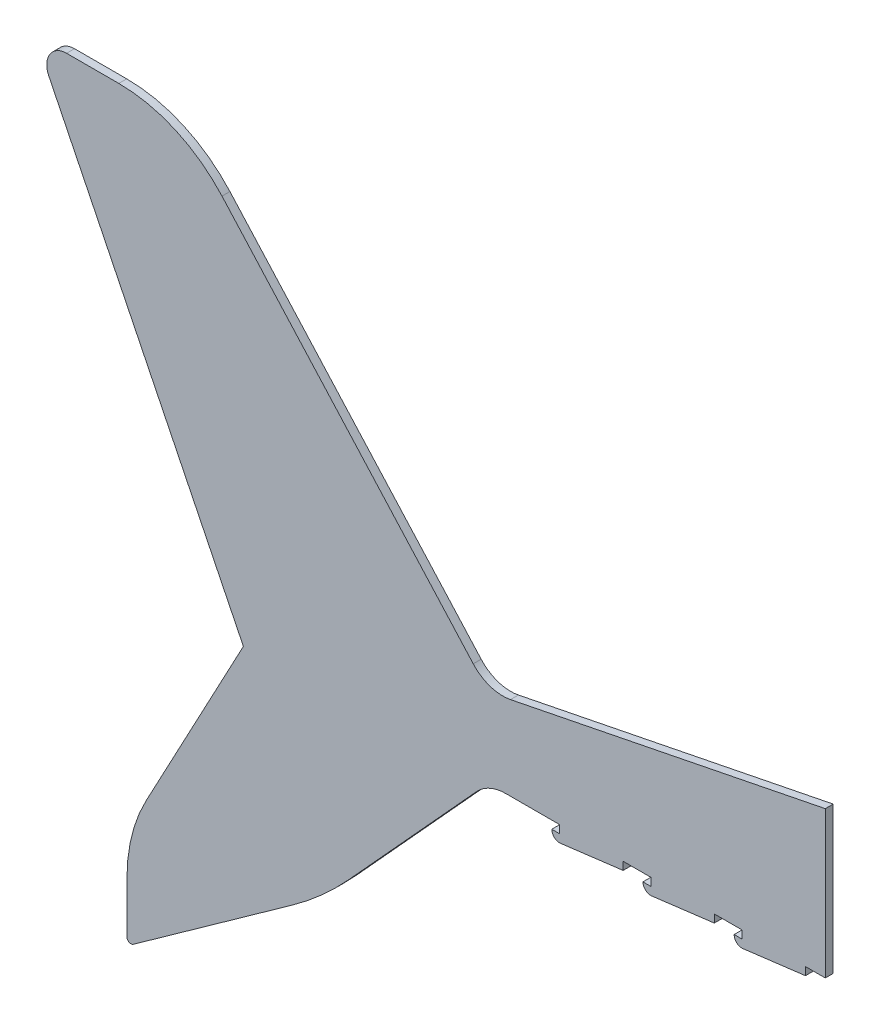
from build123d import *

# Parameters (mm, degrees)
BOSS_EXTRUDE1_DEPTH = 2
FILLET1_R           = 10
FILLET2_R           = 90
FILLET3_R           = 1
FILLET4_R           = 41
FILLET5_R           = 5
FILLET6_R           = 35
SKETCH2_W           = 16
SKETCH2_H           = 2
BOSS_EXTRUDE2_DEPTH = 2
BOSS_EXTRUDE3_DEPTH = 2
LPATTERN1_COUNT     = 3
LPATTERN1_PITCH     = 23


with BuildPart() as part:
    # Sketch1 → Boss-Extrude1 (new body)
    with BuildSketch(Plane.XY):
        Polygon((0, 0), (-85, 0), (-126.770997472, -45.816850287), (-176.155561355, -81.057678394), (-176.155561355, -55.979707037), (-146.787475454, -0.954497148), (-199.407639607, 106.324126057), (-162.616319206, 106.324126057), (-85, 20), (0, 37), align=None)
    extrude(amount=BOSS_EXTRUDE1_DEPTH)

    # Fillet1
    fillet1_edges = [part.edges().sort_by_distance(p)[0] for p in [
        (-85, 0, 1),
        (-85, 20, 1),
    ]]
    fillet(fillet1_edges, radius=FILLET1_R)

    # Fillet2
    fillet2_edges = [part.edges().sort_by_distance(p)[0] for p in [
        (-126.770997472, -45.816850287, 1),
    ]]
    fillet(fillet2_edges, radius=FILLET2_R)

    # Fillet3
    fillet3_edges = [part.edges().sort_by_distance(p)[0] for p in [
        (-176.155561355, -81.057678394, 1),
    ]]
    fillet(fillet3_edges, radius=FILLET3_R)

    # Fillet4
    fillet4_edges = [part.edges().sort_by_distance(p)[0] for p in [
        (-176.155561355, -55.979707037, 1),
    ]]
    fillet(fillet4_edges, radius=FILLET4_R)

    # Fillet5
    fillet5_edges = [part.edges().sort_by_distance(p)[0] for p in [
        (-199.407639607, 106.324126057, 1),
    ]]
    fillet(fillet5_edges, radius=FILLET5_R)

    # Fillet6
    fillet6_edges = [part.edges().sort_by_distance(p)[0] for p in [
        (-162.616319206, 106.324126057, 1),
    ]]
    fillet(fillet6_edges, radius=FILLET6_R)

    # Sketch2 → Boss-Extrude2 (add)
    with BuildSketch(Plane.XZ):
        with Locations((-13, 1)):
            Rectangle(SKETCH2_W, SKETCH2_H)
    boss_extrude2 = extrude(amount=BOSS_EXTRUDE2_DEPTH)

    # Sketch3 → Boss-Extrude3 (add)
    with BuildSketch(Plane.XY.offset(2)):
        with BuildLine():
            Line((-21, -2), (-23, -2))
            ThreePointArc((-23, -2), (-22.414213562, -3.414213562), (-21, -4))
            Line((-21, -4), (-5, -2))
            Line((-5, -2), (-21, -2))
        make_face()
    boss_extrude3 = extrude(amount=-BOSS_EXTRUDE3_DEPTH)

    # LPattern1: Boss-Extrude2, Boss-Extrude3 ×3
    with Locations(*[(-i * LPATTERN1_PITCH, 0, 0) for i in range(1, LPATTERN1_COUNT)]):
        add(boss_extrude2)
        add(boss_extrude3)


solid = part.part
